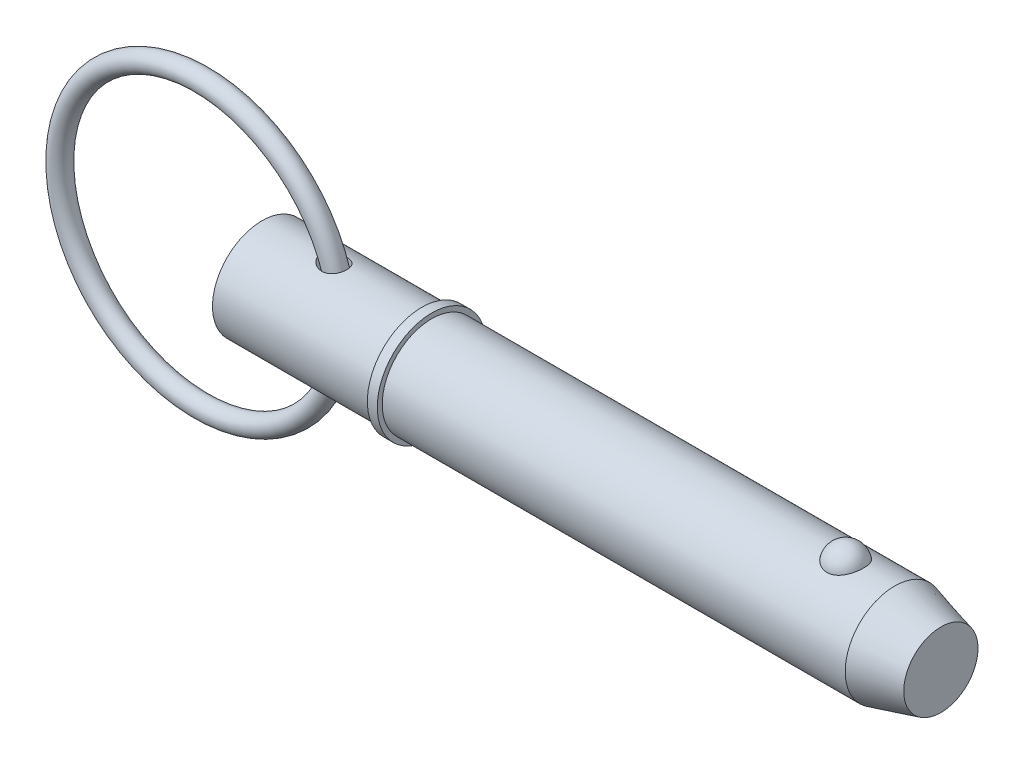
ISO-10303-21;
HEADER;
FILE_DESCRIPTION(('STEP AP214'),'2;1');
FILE_NAME('part.step','',(''),(''),'','','');
FILE_SCHEMA(('AUTOMOTIVE_DESIGN { 1 0 10303 214 1 1 1 1 }'));
ENDSEC;
DATA;
#1=APPLICATION_CONTEXT('core data for automotive mechanical design processes');
#2=APPLICATION_PROTOCOL_DEFINITION('international standard','automotive_design',2000,#1);
#3=PRODUCT_CONTEXT('',#1,'mechanical');
#4=PRODUCT('Part','Part','',(#3));
#5=PRODUCT_RELATED_PRODUCT_CATEGORY('part','',(#4));
#6=PRODUCT_DEFINITION_FORMATION('','',#4);
#7=PRODUCT_DEFINITION_CONTEXT('part definition',#1,'design');
#8=PRODUCT_DEFINITION('design','',#6,#7);
#9=PRODUCT_DEFINITION_SHAPE('','',#8);
#10=(LENGTH_UNIT() NAMED_UNIT(*) SI_UNIT(.MILLI.,.METRE.));
#11=(NAMED_UNIT(*) PLANE_ANGLE_UNIT() SI_UNIT($,.RADIAN.));
#12=(NAMED_UNIT(*) SI_UNIT($,.STERADIAN.) SOLID_ANGLE_UNIT());
#13=UNCERTAINTY_MEASURE_WITH_UNIT(LENGTH_MEASURE(1.E-05),#10,'distance_accuracy_value','');
#14=(GEOMETRIC_REPRESENTATION_CONTEXT(3) GLOBAL_UNCERTAINTY_ASSIGNED_CONTEXT((#13)) GLOBAL_UNIT_ASSIGNED_CONTEXT((#10,
#11,#12)) REPRESENTATION_CONTEXT('',''));
#15=CARTESIAN_POINT('',(0.,0.,0.));
#16=DIRECTION('',(0.,0.,1.));
#17=DIRECTION('',(1.,0.,0.));
#18=AXIS2_PLACEMENT_3D('',#15,#16,#17);
#19=CARTESIAN_POINT('',(-13.640845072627,0.,0.));
#20=DIRECTION('',(0.,0.,1.));
#21=DIRECTION('',(1.,0.,0.));
#22=AXIS2_PLACEMENT_3D('',#19,#20,#21);
#23=TOROIDAL_SURFACE('',#22,31.75,2.223);
#24=CARTESIAN_POINT('',(20.332154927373,0.,0.));
#25=VERTEX_POINT('',#24);
#26=VERTEX_LOOP('',#25);
#27=FACE_BOUND('',#26,.T.);
#28=ADVANCED_FACE('P0_F12',(#27),#23,.T.);
#29=CLOSED_SHELL('',(#28));
#30=MANIFOLD_SOLID_BREP('P0_B1',#29);
#31=CARTESIAN_POINT('',(0.,0.,0.));
#32=DIRECTION('',(1.,0.,0.));
#33=DIRECTION('',(0.,0.,-1.));
#34=AXIS2_PLACEMENT_3D('',#31,#32,#33);
#35=CYLINDRICAL_SURFACE('',#34,11.115);
#36=CARTESIAN_POINT('',(13.5245830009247,11.0328953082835,-1.34849772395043));
#37=CARTESIAN_POINT('',(13.6190616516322,11.0150940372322,-1.49413162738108));
#38=CARTESIAN_POINT('',(13.7272589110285,10.9954577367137,-1.63076546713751));
#39=CARTESIAN_POINT('',(13.9654537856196,10.9550099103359,-1.8834727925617));
#40=CARTESIAN_POINT('',(14.0954990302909,10.9341958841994,-1.99950019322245));
#41=CARTESIAN_POINT('',(14.3718600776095,10.893854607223,-2.20871939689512));
#42=CARTESIAN_POINT('',(14.5180879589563,10.8743212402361,-2.30202655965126));
#43=CARTESIAN_POINT('',(14.8233821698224,10.8385071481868,-2.46515115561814));
#44=CARTESIAN_POINT('',(14.9824448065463,10.8222254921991,-2.53497531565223));
#45=CARTESIAN_POINT('',(15.3233581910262,10.7936101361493,-2.65430007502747));
#46=CARTESIAN_POINT('',(15.5060064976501,10.7817126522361,-2.7016502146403));
#47=CARTESIAN_POINT('',(15.8771124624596,10.7657570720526,-2.76455948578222));
#48=CARTESIAN_POINT('',(16.0655695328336,10.7616981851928,-2.78012182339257));
#49=CARTESIAN_POINT('',(16.4345152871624,10.7624400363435,-2.77724928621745));
#50=CARTESIAN_POINT('',(16.6150121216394,10.7668823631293,-2.76018977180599));
#51=CARTESIAN_POINT('',(16.9695132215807,10.7837407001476,-2.69357457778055));
#52=CARTESIAN_POINT('',(17.1435222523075,10.7961507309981,-2.64404326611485));
#53=CARTESIAN_POINT('',(17.4621418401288,10.8258984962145,-2.51928348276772));
#54=CARTESIAN_POINT('',(17.6079677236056,10.8426430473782,-2.44700611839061));
#55=CARTESIAN_POINT('',(17.884162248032,10.8794194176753,-2.27791740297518));
#56=CARTESIAN_POINT('',(18.0145349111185,10.8994503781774,-2.18111245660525));
#57=CARTESIAN_POINT('',(18.2494965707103,10.9392822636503,-1.9713196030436));
#58=CARTESIAN_POINT('',(18.3550661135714,10.9590421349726,-1.85941863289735));
#59=CARTESIAN_POINT('',(18.5458147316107,10.9970986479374,-1.61919918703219));
#60=CARTESIAN_POINT('',(18.6309947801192,11.0153953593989,-1.49088149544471));
#61=CARTESIAN_POINT('',(18.7786686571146,11.0484675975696,-1.2218388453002));
#62=CARTESIAN_POINT('',(18.8412214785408,11.063252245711,-1.08114735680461));
#63=CARTESIAN_POINT('',(18.9425265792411,11.0877718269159,-0.791025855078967));
#64=CARTESIAN_POINT('',(18.9812780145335,11.0975065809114,-0.641595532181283));
#65=CARTESIAN_POINT('',(19.0343305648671,11.1109435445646,-0.336997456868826));
#66=CARTESIAN_POINT('',(19.0484404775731,11.1145985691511,-0.181794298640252));
#67=CARTESIAN_POINT('',(19.0513147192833,11.1153384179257,0.128864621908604));
#68=CARTESIAN_POINT('',(19.0400783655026,11.112423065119,0.284320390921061));
#69=CARTESIAN_POINT('',(18.9924362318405,11.1003163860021,0.591525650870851));
#70=CARTESIAN_POINT('',(18.9559600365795,11.0911075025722,0.743263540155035));
#71=CARTESIAN_POINT('',(18.858576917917,11.0673920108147,1.0382524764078));
#72=CARTESIAN_POINT('',(18.7976699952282,11.0528854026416,1.18150352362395));
#73=CARTESIAN_POINT('',(18.6529960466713,11.020201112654,1.45511394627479));
#74=CARTESIAN_POINT('',(18.5692772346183,11.0020311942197,1.58549973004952));
#75=CARTESIAN_POINT('',(18.3810003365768,10.9640237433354,1.82995492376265));
#76=CARTESIAN_POINT('',(18.2764441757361,10.9441863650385,1.94402583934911));
#77=CARTESIAN_POINT('',(18.0501398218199,10.9052267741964,2.15183128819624));
#78=CARTESIAN_POINT('',(17.9285270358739,10.8861003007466,2.24571250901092));
#79=CARTESIAN_POINT('',(17.6709592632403,10.8505244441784,2.41175942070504));
#80=CARTESIAN_POINT('',(17.5350055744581,10.8340748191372,2.48392707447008));
#81=CARTESIAN_POINT('',(17.2528390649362,10.8056099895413,2.60497667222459));
#82=CARTESIAN_POINT('',(17.1066353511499,10.7935909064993,2.65387899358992));
#83=CARTESIAN_POINT('',(16.8080326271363,10.7750969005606,2.72799859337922));
#84=CARTESIAN_POINT('',(16.6556326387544,10.7686228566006,2.75321211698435));
#85=CARTESIAN_POINT('',(16.3428877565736,10.761517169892,2.78086153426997));
#86=CARTESIAN_POINT('',(16.1824599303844,10.7611149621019,2.78240297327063));
#87=CARTESIAN_POINT('',(15.863296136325,10.766478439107,2.76156874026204));
#88=CARTESIAN_POINT('',(15.7045607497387,10.7722461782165,2.73918510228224));
#89=CARTESIAN_POINT('',(15.3787211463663,10.7898500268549,2.66904167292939));
#90=CARTESIAN_POINT('',(15.2120794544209,10.8021675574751,2.61925575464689));
#91=CARTESIAN_POINT('',(14.8886284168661,10.8315482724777,2.49496357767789));
#92=CARTESIAN_POINT('',(14.731827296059,10.8486153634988,2.42043695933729));
#93=CARTESIAN_POINT('',(14.4198762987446,10.8870804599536,2.24137362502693));
#94=CARTESIAN_POINT('',(14.2658484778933,10.9087148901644,2.13492229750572));
#95=CARTESIAN_POINT('',(13.9788214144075,10.9526299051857,1.89676517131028));
#96=CARTESIAN_POINT('',(13.8458041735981,10.9749099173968,1.76508120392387));
#97=CARTESIAN_POINT('',(13.6310853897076,11.012885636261,1.50762337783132));
#98=CARTESIAN_POINT('',(13.5444453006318,11.0290026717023,1.38602082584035));
#99=CARTESIAN_POINT('',(13.392158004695,11.0581740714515,1.12983363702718));
#100=CARTESIAN_POINT('',(13.3264946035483,11.0712307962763,0.995259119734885));
#101=CARTESIAN_POINT('',(13.2464179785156,11.0874250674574,0.785640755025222));
#102=CARTESIAN_POINT('',(13.2227369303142,11.0922707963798,0.714166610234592));
#103=CARTESIAN_POINT('',(13.1820656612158,11.1006486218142,0.569277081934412));
#104=CARTESIAN_POINT('',(13.1650721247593,11.1041813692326,0.495862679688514));
#105=CARTESIAN_POINT('',(13.1381118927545,11.1098070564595,0.347711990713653));
#106=CARTESIAN_POINT('',(13.1281436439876,11.1119003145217,0.272975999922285));
#107=CARTESIAN_POINT('',(13.1154243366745,11.1145746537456,0.122890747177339));
#108=CARTESIAN_POINT('',(13.1126723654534,11.1151559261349,0.0475415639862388));
#109=CARTESIAN_POINT('',(13.115160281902,11.1146296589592,-0.160384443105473));
#110=CARTESIAN_POINT('',(13.128061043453,11.111903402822,-0.292944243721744));
#111=CARTESIAN_POINT('',(13.175691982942,11.1019662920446,-0.553751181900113));
#112=CARTESIAN_POINT('',(13.2104121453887,11.094757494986,-0.682000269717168));
#113=CARTESIAN_POINT('',(13.2891255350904,11.0787645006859,-0.901873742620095));
#114=CARTESIAN_POINT('',(13.3290466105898,11.0707438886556,-0.995044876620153));
#115=CARTESIAN_POINT('',(13.4192915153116,11.0529876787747,-1.17599209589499));
#116=CARTESIAN_POINT('',(13.4696154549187,11.0432520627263,-1.26376812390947));
#117=CARTESIAN_POINT('',(13.5245830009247,11.0328953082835,-1.34849772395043));
#118=B_SPLINE_CURVE_WITH_KNOTS('',3,(#36,#37,#38,#39,#40,#41,#42,#43,#44,#45,#46,#47,#48,#49,
#50,#51,#52,#53,#54,#55,#56,#57,#58,#59,#60,#61,#62,#63,#64,#65,#66,#67,#68,#69,#70,#71,#72,#73,
#74,#75,#76,#77,#78,#79,#80,#81,#82,#83,#84,#85,#86,#87,#88,#89,#90,#91,#92,#93,#94,#95,#96,#97,
#98,#99,#100,#101,#102,#103,#104,#105,#106,#107,#108,#109,#110,#111,#112,#113,#114,#115,#116,
#117),.UNSPECIFIED.,.T.,.F.,(4,2,2,2,2,2,2,2,2,2,2,2,2,2,2,2,2,2,2,2,2,2,2,2,2,2,2,2,2,2,2,2,2,
2,2,2,2,2,2,2,4),(0.,0.52309976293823,1.04735506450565,1.56889024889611,2.09027590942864,
2.65465173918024,3.21897064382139,3.76002078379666,4.30066536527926,4.78898318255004,
5.27717362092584,5.74028268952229,6.20336964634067,6.665240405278,7.12712754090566,
7.59258295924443,8.05805091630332,8.52482272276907,8.99159451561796,9.45738731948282,
9.9231371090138,10.3853792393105,10.8475795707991,11.3093743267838,11.7712422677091,
12.2505208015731,12.7299589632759,13.2508366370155,13.7721440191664,14.334890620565,
14.8971525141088,15.3459336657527,15.7943675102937,16.0204422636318,16.2464047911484,
16.4723173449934,16.6982013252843,17.095711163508,17.4930386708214,17.7973741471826,
18.1017128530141),.UNSPECIFIED.);
#119=CARTESIAN_POINT('',(13.5245830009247,11.0328953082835,-1.34849772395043));
#120=VERTEX_POINT('',#119);
#121=EDGE_CURVE('P1_E42',#120,#120,#118,.T.);
#122=ORIENTED_EDGE('',*,*,#121,.T.);
#123=EDGE_LOOP('',(#122));
#124=FACE_BOUND('',#123,.T.);
#125=CARTESIAN_POINT('',(0.,0.,0.));
#126=DIRECTION('',(1.,0.,0.));
#127=DIRECTION('',(0.,0.,-1.));
#128=AXIS2_PLACEMENT_3D('',#125,#126,#127);
#129=CIRCLE('',#128,11.115);
#130=CARTESIAN_POINT('',(0.,0.,-11.115));
#131=VERTEX_POINT('',#130);
#132=EDGE_CURVE('P1_E9',#131,#131,#129,.T.);
#133=ORIENTED_EDGE('',*,*,#132,.T.);
#134=EDGE_LOOP('',(#133));
#135=FACE_BOUND('',#134,.T.);
#136=CARTESIAN_POINT('',(35.877,0.,0.));
#137=DIRECTION('',(1.,0.,0.));
#138=DIRECTION('',(0.,0.,-1.));
#139=AXIS2_PLACEMENT_3D('',#136,#137,#138);
#140=CIRCLE('',#139,11.115);
#141=CARTESIAN_POINT('',(35.877,0.,-11.115));
#142=VERTEX_POINT('',#141);
#143=EDGE_CURVE('P1_E25',#142,#142,#140,.T.);
#144=ORIENTED_EDGE('',*,*,#143,.F.);
#145=EDGE_LOOP('',(#144));
#146=FACE_BOUND('',#145,.T.);
#147=CARTESIAN_POINT('',(13.5245830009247,-11.0328953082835,-1.34849772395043));
#148=CARTESIAN_POINT('',(13.449887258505,-11.0469690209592,-1.233356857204));
#149=CARTESIAN_POINT('',(13.3837464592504,-11.0598986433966,-1.11255897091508));
#150=CARTESIAN_POINT('',(13.271526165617,-11.0822620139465,-0.861680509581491));
#151=CARTESIAN_POINT('',(13.2254273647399,-11.0916991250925,-0.731609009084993));
#152=CARTESIAN_POINT('',(13.1557497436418,-11.1060943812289,-0.464578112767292));
#153=CARTESIAN_POINT('',(13.1322820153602,-11.111030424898,-0.327588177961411));
#154=CARTESIAN_POINT('',(13.1098958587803,-11.1157368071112,-0.0515139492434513));
#155=CARTESIAN_POINT('',(13.1109730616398,-11.1155080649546,0.0875699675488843));
#156=CARTESIAN_POINT('',(13.1367722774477,-11.110088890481,0.354927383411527));
#157=CARTESIAN_POINT('',(13.160070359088,-11.1051972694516,0.483348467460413));
#158=CARTESIAN_POINT('',(13.2268311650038,-11.091413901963,0.734581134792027));
#159=CARTESIAN_POINT('',(13.2702981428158,-11.0825213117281,0.857391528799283));
#160=CARTESIAN_POINT('',(13.3769008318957,-11.0612491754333,1.09871322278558));
#161=CARTESIAN_POINT('',(13.4406446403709,-11.048763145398,1.21694419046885));
#162=CARTESIAN_POINT('',(13.5844860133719,-11.0215642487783,1.44267020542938));
#163=CARTESIAN_POINT('',(13.6645903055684,-11.0068504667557,1.55016080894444));
#164=CARTESIAN_POINT('',(13.8511803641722,-10.9741237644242,1.76795565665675));
#165=CARTESIAN_POINT('',(13.959808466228,-10.9559422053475,1.87639683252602));
#166=CARTESIAN_POINT('',(14.1916437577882,-10.9197998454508,2.07642617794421));
#167=CARTESIAN_POINT('',(14.3148607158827,-10.901839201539,2.16800294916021));
#168=CARTESIAN_POINT('',(14.5931107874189,-10.8649902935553,2.34622033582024));
#169=CARTESIAN_POINT('',(14.7501095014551,-10.8463937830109,2.42986679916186));
#170=CARTESIAN_POINT('',(15.0757118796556,-10.8136392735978,2.57171975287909));
#171=CARTESIAN_POINT('',(15.2443214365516,-10.7994835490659,2.62991321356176));
#172=CARTESIAN_POINT('',(15.599068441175,-10.7767894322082,2.72147498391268));
#173=CARTESIAN_POINT('',(15.7856559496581,-10.768622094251,2.75321798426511));
#174=CARTESIAN_POINT('',(16.1617095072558,-10.7608206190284,2.78356776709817));
#175=CARTESIAN_POINT('',(16.3511739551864,-10.7611818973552,2.78219235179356));
#176=CARTESIAN_POINT('',(16.7138126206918,-10.7705428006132,2.7457129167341));
#177=CARTESIAN_POINT('',(16.8872269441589,-10.7789612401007,2.71287798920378));
#178=CARTESIAN_POINT('',(17.2247245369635,-10.8028011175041,2.61632772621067));
#179=CARTESIAN_POINT('',(17.3888134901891,-10.8182182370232,2.55263143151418));
#180=CARTESIAN_POINT('',(17.6871641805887,-10.8524191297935,2.40281428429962));
#181=CARTESIAN_POINT('',(17.8227812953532,-10.8707652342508,2.31928155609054));
#182=CARTESIAN_POINT('',(18.0770765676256,-10.9094513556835,2.12988301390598));
#183=CARTESIAN_POINT('',(18.1957578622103,-10.9297910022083,2.0240213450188));
#184=CARTESIAN_POINT('',(18.4088055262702,-10.9693230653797,1.79719870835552));
#185=CARTESIAN_POINT('',(18.5038890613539,-10.9885305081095,1.67691225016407));
#186=CARTESIAN_POINT('',(18.6726701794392,-11.0244347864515,1.42183894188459));
#187=CARTESIAN_POINT('',(18.7463681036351,-11.0411316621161,1.28705232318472));
#188=CARTESIAN_POINT('',(18.8708297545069,-11.0702507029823,1.00634471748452));
#189=CARTESIAN_POINT('',(18.9215212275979,-11.0826593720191,0.860390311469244));
#190=CARTESIAN_POINT('',(18.9984973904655,-11.1017993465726,0.561823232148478));
#191=CARTESIAN_POINT('',(19.0247811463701,-11.1085304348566,0.409210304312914));
#192=CARTESIAN_POINT('',(19.0524622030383,-11.1156244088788,0.100537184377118));
#193=CARTESIAN_POINT('',(19.0536873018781,-11.1159432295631,-0.0555394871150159));
#194=CARTESIAN_POINT('',(19.0307837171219,-11.110065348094,-0.365700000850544));
#195=CARTESIAN_POINT('',(19.0066544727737,-11.1038685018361,-0.519783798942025));
#196=CARTESIAN_POINT('',(18.9335163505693,-11.0856111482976,-0.821817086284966));
#197=CARTESIAN_POINT('',(18.88447016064,-11.0735418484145,-0.969757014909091));
#198=CARTESIAN_POINT('',(18.7625929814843,-11.0448501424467,-1.25502066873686));
#199=CARTESIAN_POINT('',(18.6897623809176,-11.0282278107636,-1.39234456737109));
#200=CARTESIAN_POINT('',(18.522359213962,-10.9923333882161,-1.65195905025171));
#201=CARTESIAN_POINT('',(18.427863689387,-10.9730707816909,-1.77430060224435));
#202=CARTESIAN_POINT('',(18.2194216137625,-10.9340072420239,-2.00099176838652));
#203=CARTESIAN_POINT('',(18.1054772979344,-10.9142063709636,-2.10534344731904));
#204=CARTESIAN_POINT('',(17.8622613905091,-10.8764452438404,-2.2924289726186));
#205=CARTESIAN_POINT('',(17.7331196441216,-10.8584715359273,-2.3753290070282));
#206=CARTESIAN_POINT('',(17.4625069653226,-10.8261386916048,-2.51860389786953));
#207=CARTESIAN_POINT('',(17.3210365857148,-10.8117793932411,-2.57897976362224));
#208=CARTESIAN_POINT('',(17.0290309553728,-10.7880576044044,-2.67648805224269));
#209=CARTESIAN_POINT('',(16.8784484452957,-10.7787241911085,-2.71348542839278));
#210=CARTESIAN_POINT('',(16.573148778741,-10.7659618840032,-2.7636855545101));
#211=CARTESIAN_POINT('',(16.4184306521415,-10.7625343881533,-2.77688267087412));
#212=CARTESIAN_POINT('',(16.1008073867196,-10.761643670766,-2.78033419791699));
#213=CARTESIAN_POINT('',(15.9378898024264,-10.7644957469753,-2.76937572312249));
#214=CARTESIAN_POINT('',(15.6157286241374,-10.7762062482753,-2.72344300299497));
#215=CARTESIAN_POINT('',(15.4564861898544,-10.7850665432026,-2.68846128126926));
#216=CARTESIAN_POINT('',(15.1305734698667,-10.808737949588,-2.59174021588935));
#217=CARTESIAN_POINT('',(14.9645834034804,-10.8240246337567,-2.52782071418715));
#218=CARTESIAN_POINT('',(14.6448218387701,-10.8585969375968,-2.37491543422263));
#219=CARTESIAN_POINT('',(14.4910653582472,-10.8778873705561,-2.28589943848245));
#220=CARTESIAN_POINT('',(14.1837929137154,-10.920550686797,-2.07312951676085));
#221=CARTESIAN_POINT('',(14.0321999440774,-10.9441390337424,-1.94661563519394));
#222=CARTESIAN_POINT('',(13.756115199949,-10.9902311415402,-1.66673537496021));
#223=CARTESIAN_POINT('',(13.6315733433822,-11.0127368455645,-1.51341958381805));
#224=CARTESIAN_POINT('',(13.5245830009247,-11.0328953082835,-1.34849772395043));
#225=B_SPLINE_CURVE_WITH_KNOTS('',3,(#147,#148,#149,#150,#151,#152,#153,#154,#155,#156,#157,
#158,#159,#160,#161,#162,#163,#164,#165,#166,#167,#168,#169,#170,#171,#172,#173,#174,#175,#176,
#177,#178,#179,#180,#181,#182,#183,#184,#185,#186,#187,#188,#189,#190,#191,#192,#193,#194,#195,
#196,#197,#198,#199,#200,#201,#202,#203,#204,#205,#206,#207,#208,#209,#210,#211,#212,#213,#214,
#215,#216,#217,#218,#219,#220,#221,#222,#223,#224),.UNSPECIFIED.,.T.,.F.,(4,2,2,2,2,2,2,2,2,2,2,
2,2,2,2,2,2,2,2,2,2,2,2,2,2,2,2,2,2,2,2,2,2,2,2,2,2,2,4),(0.,0.4133945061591,0.8263899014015,
1.24140245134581,1.65634113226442,2.04635967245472,2.43646050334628,2.83958259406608,
3.24287078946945,3.70479277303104,4.16702582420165,4.70130512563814,5.23585761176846,
5.80123945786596,6.36631739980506,6.89348344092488,7.42032464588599,7.8989135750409,
8.37741373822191,8.83881993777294,9.30021877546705,9.76305681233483,10.2259125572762,
10.6919479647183,11.1579936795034,11.6247393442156,12.0914773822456,12.55658073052,
13.0216306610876,13.4829619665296,13.9442725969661,14.408224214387,14.8722856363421,
15.3601762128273,15.8482186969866,16.3815107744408,16.9154477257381,17.5086806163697,
18.1008056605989),.UNSPECIFIED.);
#226=CARTESIAN_POINT('',(13.5245830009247,-11.0328953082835,-1.34849772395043));
#227=VERTEX_POINT('',#226);
#228=EDGE_CURVE('P1_E17',#227,#227,#225,.T.);
#229=ORIENTED_EDGE('',*,*,#228,.T.);
#230=EDGE_LOOP('',(#229));
#231=FACE_BOUND('',#230,.T.);
#232=ADVANCED_FACE('P1_F13',(#124,#135,#146,#231),#35,.T.);
#233=CARTESIAN_POINT('',(0.,0.,0.));
#234=DIRECTION('',(1.,0.,0.));
#235=DIRECTION('',(0.,0.,-1.));
#236=AXIS2_PLACEMENT_3D('',#233,#234,#235);
#237=CYLINDRICAL_SURFACE('',#236,11.115);
#238=CARTESIAN_POINT('',(142.029563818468,0.,0.));
#239=DIRECTION('',(1.,0.,0.));
#240=DIRECTION('',(0.,0.,-1.));
#241=AXIS2_PLACEMENT_3D('',#238,#239,#240);
#242=CIRCLE('',#241,11.115);
#243=CARTESIAN_POINT('',(142.029563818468,0.,-11.115));
#244=VERTEX_POINT('',#243);
#245=EDGE_CURVE('P1_E99',#244,#244,#242,.T.);
#246=ORIENTED_EDGE('',*,*,#245,.F.);
#247=EDGE_LOOP('',(#246));
#248=FACE_BOUND('',#247,.T.);
#249=CARTESIAN_POINT('',(38.1,0.,0.));
#250=DIRECTION('',(1.,0.,0.));
#251=DIRECTION('',(0.,0.,-1.));
#252=AXIS2_PLACEMENT_3D('',#249,#250,#251);
#253=CIRCLE('',#252,11.115);
#254=CARTESIAN_POINT('',(38.1,0.,-11.115));
#255=VERTEX_POINT('',#254);
#256=EDGE_CURVE('P1_E96',#255,#255,#253,.T.);
#257=ORIENTED_EDGE('',*,*,#256,.T.);
#258=EDGE_LOOP('',(#257));
#259=FACE_BOUND('',#258,.T.);
#260=CARTESIAN_POINT('',(131.031068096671,10.3028087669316,4.17077409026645));
#261=CARTESIAN_POINT('',(130.814775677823,10.3028003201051,4.17078240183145));
#262=CARTESIAN_POINT('',(130.598548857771,10.3098895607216,4.15340593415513));
#263=CARTESIAN_POINT('',(130.172540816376,10.3373834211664,4.08449540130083));
#264=CARTESIAN_POINT('',(129.962757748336,10.3577841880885,4.0329712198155));
#265=CARTESIAN_POINT('',(129.555782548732,10.4095237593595,3.89746513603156));
#266=CARTESIAN_POINT('',(129.358572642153,10.4408466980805,3.81353029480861));
#267=CARTESIAN_POINT('',(128.981338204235,10.5110236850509,3.61560339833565));
#268=CARTESIAN_POINT('',(128.801317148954,10.5498792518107,3.50160528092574));
#269=CARTESIAN_POINT('',(128.457684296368,10.6322884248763,3.24292464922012));
#270=CARTESIAN_POINT('',(128.294686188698,10.6759443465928,3.09746040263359));
#271=CARTESIAN_POINT('',(127.994591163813,10.7625291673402,2.7817192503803));
#272=CARTESIAN_POINT('',(127.857499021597,10.8054579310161,2.61143778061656));
#273=CARTESIAN_POINT('',(127.606408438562,10.8881935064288,2.24226695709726));
#274=CARTESIAN_POINT('',(127.493710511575,10.9277761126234,2.04244123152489));
#275=CARTESIAN_POINT('',(127.301777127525,10.997484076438,1.62578254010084));
#276=CARTESIAN_POINT('',(127.222544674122,11.0276085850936,1.40894804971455));
#277=CARTESIAN_POINT('',(127.098303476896,11.0756732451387,0.961250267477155));
#278=CARTESIAN_POINT('',(127.053760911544,11.0934470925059,0.730239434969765));
#279=CARTESIAN_POINT('',(127.001569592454,11.1143331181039,0.263439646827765));
#280=CARTESIAN_POINT('',(126.993920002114,11.1174456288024,0.0276507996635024));
#281=CARTESIAN_POINT('',(127.01561056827,11.1087161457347,-0.44072963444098));
#282=CARTESIAN_POINT('',(127.044762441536,11.0969502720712,-0.673331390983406));
#283=CARTESIAN_POINT('',(127.139143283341,11.0597872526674,-1.12996621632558));
#284=CARTESIAN_POINT('',(127.204372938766,11.0343898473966,-1.35399912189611));
#285=CARTESIAN_POINT('',(127.36969844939,10.972515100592,-1.78750286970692));
#286=CARTESIAN_POINT('',(127.46983863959,10.9360236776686,-1.99695478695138));
#287=CARTESIAN_POINT('',(127.702940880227,10.8557595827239,-2.39520667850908));
#288=CARTESIAN_POINT('',(127.835905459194,10.8119863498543,-2.58400506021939));
#289=CARTESIAN_POINT('',(128.132407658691,10.7216733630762,-2.93635726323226));
#290=CARTESIAN_POINT('',(128.296056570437,10.675123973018,-3.09981510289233));
#291=CARTESIAN_POINT('',(128.649860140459,10.5846571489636,-3.39592247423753));
#292=CARTESIAN_POINT('',(128.840012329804,10.5407394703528,-3.52857487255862));
#293=CARTESIAN_POINT('',(129.23750141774,10.4616690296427,-3.75646057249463));
#294=CARTESIAN_POINT('',(129.44436705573,10.4263443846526,-3.85245432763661));
#295=CARTESIAN_POINT('',(129.872954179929,10.3675574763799,-4.00798747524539));
#296=CARTESIAN_POINT('',(130.094670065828,10.344090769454,-4.0675405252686));
#297=CARTESIAN_POINT('',(130.534669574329,10.3128282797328,-4.14614314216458));
#298=CARTESIAN_POINT('',(130.752565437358,10.3043040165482,-4.1670783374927));
#299=CARTESIAN_POINT('',(131.18894951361,10.3016771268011,-4.17357158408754));
#300=CARTESIAN_POINT('',(131.407437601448,10.3075716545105,-4.15913661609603));
#301=CARTESIAN_POINT('',(131.831744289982,10.3326686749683,-4.09636961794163));
#302=CARTESIAN_POINT('',(132.037745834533,10.3514555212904,-4.0490957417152));
#303=CARTESIAN_POINT('',(132.438576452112,10.399818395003,-3.92320197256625));
#304=CARTESIAN_POINT('',(132.6334046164,10.4293952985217,-3.84457953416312));
#305=CARTESIAN_POINT('',(133.011191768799,10.4969600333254,-3.65612410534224));
#306=CARTESIAN_POINT('',(133.193797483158,10.5351178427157,-3.54564545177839));
#307=CARTESIAN_POINT('',(133.538204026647,10.6154999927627,-3.29718036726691));
#308=CARTESIAN_POINT('',(133.700000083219,10.657725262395,-3.15918764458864));
#309=CARTESIAN_POINT('',(134.006959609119,10.744212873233,-2.85163580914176));
#310=CARTESIAN_POINT('',(134.150891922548,10.7884718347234,-2.68084605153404));
#311=CARTESIAN_POINT('',(134.409237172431,10.872374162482,-2.31721864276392));
#312=CARTESIAN_POINT('',(134.523644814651,10.9120167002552,-2.12437704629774));
#313=CARTESIAN_POINT('',(134.723873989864,10.9838919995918,-1.71516999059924));
#314=CARTESIAN_POINT('',(134.80866178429,11.0158465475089,-1.49824866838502));
#315=CARTESIAN_POINT('',(134.94268382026,11.0673523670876,-1.05228572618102));
#316=CARTESIAN_POINT('',(134.991917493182,11.086903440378,-0.823243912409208));
#317=CARTESIAN_POINT('',(135.053891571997,11.1116323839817,-0.3590874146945));
#318=CARTESIAN_POINT('',(135.066566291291,11.1167843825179,-0.123962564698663));
#319=CARTESIAN_POINT('',(135.054973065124,11.1121144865,0.345220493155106));
#320=CARTESIAN_POINT('',(135.030705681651,11.1022928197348,0.579278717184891));
#321=CARTESIAN_POINT('',(134.945907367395,11.0687504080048,1.03866534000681));
#322=CARTESIAN_POINT('',(134.885529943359,11.0450885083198,1.26402641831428));
#323=CARTESIAN_POINT('',(134.729853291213,10.9863185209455,1.70076772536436));
#324=CARTESIAN_POINT('',(134.634551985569,10.9512097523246,1.91214712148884));
#325=CARTESIAN_POINT('',(134.410397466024,10.8729733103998,2.316083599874));
#326=CARTESIAN_POINT('',(134.281380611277,10.8298068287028,2.50854240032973));
#327=CARTESIAN_POINT('',(133.992732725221,10.7401896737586,2.86808766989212));
#328=CARTESIAN_POINT('',(133.833102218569,10.6937390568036,3.03517457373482));
#329=CARTESIAN_POINT('',(133.487534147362,10.6029321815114,3.33857581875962));
#330=CARTESIAN_POINT('',(133.301708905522,10.5585680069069,3.47501541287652));
#331=CARTESIAN_POINT('',(132.907875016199,10.4769321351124,3.71390897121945));
#332=CARTESIAN_POINT('',(132.699863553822,10.439661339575,3.81635861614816));
#333=CARTESIAN_POINT('',(132.254066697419,10.3749407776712,3.98910631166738));
#334=CARTESIAN_POINT('',(132.015234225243,10.3482457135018,4.05700929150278));
#335=CARTESIAN_POINT('',(131.527925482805,10.312188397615,4.14782844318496));
#336=CARTESIAN_POINT('',(131.279453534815,10.3028184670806,4.17076454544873));
#337=CARTESIAN_POINT('',(131.031068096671,10.3028087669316,4.17077409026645));
#338=B_SPLINE_CURVE_WITH_KNOTS('',3,(#260,#261,#262,#263,#264,#265,#266,#267,#268,#269,#270,
#271,#272,#273,#274,#275,#276,#277,#278,#279,#280,#281,#282,#283,#284,#285,#286,#287,#288,#289,
#290,#291,#292,#293,#294,#295,#296,#297,#298,#299,#300,#301,#302,#303,#304,#305,#306,#307,#308,
#309,#310,#311,#312,#313,#314,#315,#316,#317,#318,#319,#320,#321,#322,#323,#324,#325,#326,#327,
#328,#329,#330,#331,#332,#333,#334,#335,#336,#337),.UNSPECIFIED.,.T.,.F.,(4,2,2,2,2,2,2,2,2,2,2,
2,2,2,2,2,2,2,2,2,2,2,2,2,2,2,2,2,2,2,2,2,2,2,2,2,2,2,4),(0.,0.64796614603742,1.29574482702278,
1.94258643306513,2.58955857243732,3.25496465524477,3.92049326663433,4.61566368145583,
5.31089647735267,6.01531821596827,6.71972398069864,7.42054043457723,8.12137023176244,
8.8230933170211,9.52487047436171,10.2292439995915,10.9335519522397,11.6223330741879,
12.3108558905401,12.9647664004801,13.6185478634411,14.252184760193,14.8858731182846,
15.5334360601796,16.1811472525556,16.8611459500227,17.5412664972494,18.2431855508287,
18.9451158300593,19.6483065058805,20.3514864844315,21.0516982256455,21.7519516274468,
22.4556690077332,23.1593743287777,23.8601491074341,24.5610129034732,25.3054529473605,
26.049562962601),.UNSPECIFIED.);
#339=CARTESIAN_POINT('',(131.031068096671,10.3028087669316,4.17077409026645));
#340=VERTEX_POINT('',#339);
#341=EDGE_CURVE('P1_E34',#340,#340,#338,.T.);
#342=ORIENTED_EDGE('',*,*,#341,.T.);
#343=EDGE_LOOP('',(#342));
#344=FACE_BOUND('',#343,.T.);
#345=ADVANCED_FACE('P1_F46',(#248,#259,#344),#237,.T.);
#346=CARTESIAN_POINT('',(0.,0.,0.));
#347=DIRECTION('',(-1.,0.,0.));
#348=DIRECTION('',(0.,0.,1.));
#349=AXIS2_PLACEMENT_3D('',#346,#347,#348);
#350=PLANE('',#349);
#351=ORIENTED_EDGE('',*,*,#132,.F.);
#352=EDGE_LOOP('',(#351));
#353=FACE_BOUND('',#352,.T.);
#354=ADVANCED_FACE('P1_F15',(#353),#350,.T.);
#355=CARTESIAN_POINT('',(35.877,11.115,0.));
#356=DIRECTION('',(-1.,0.,0.));
#357=DIRECTION('',(0.,0.,1.));
#358=AXIS2_PLACEMENT_3D('',#355,#356,#357);
#359=PLANE('',#358);
#360=ORIENTED_EDGE('',*,*,#143,.T.);
#361=EDGE_LOOP('',(#360));
#362=FACE_BOUND('',#361,.T.);
#363=CARTESIAN_POINT('',(35.877,0.,0.));
#364=DIRECTION('',(1.,0.,0.));
#365=DIRECTION('',(0.,0.,-1.));
#366=AXIS2_PLACEMENT_3D('',#363,#364,#365);
#367=CIRCLE('',#366,12.2265);
#368=CARTESIAN_POINT('',(35.877,0.,-12.2265));
#369=VERTEX_POINT('',#368);
#370=EDGE_CURVE('P1_E30',#369,#369,#367,.T.);
#371=ORIENTED_EDGE('',*,*,#370,.F.);
#372=EDGE_LOOP('',(#371));
#373=FACE_BOUND('',#372,.T.);
#374=ADVANCED_FACE('P1_F81',(#362,#373),#359,.T.);
#375=CARTESIAN_POINT('',(0.,0.,0.));
#376=DIRECTION('',(1.,0.,0.));
#377=DIRECTION('',(0.,0.,-1.));
#378=AXIS2_PLACEMENT_3D('',#375,#376,#377);
#379=CYLINDRICAL_SURFACE('',#378,12.2265);
#380=ORIENTED_EDGE('',*,*,#370,.T.);
#381=EDGE_LOOP('',(#380));
#382=FACE_BOUND('',#381,.T.);
#383=CARTESIAN_POINT('',(38.1,0.,0.));
#384=DIRECTION('',(1.,0.,0.));
#385=DIRECTION('',(0.,0.,-1.));
#386=AXIS2_PLACEMENT_3D('',#383,#384,#385);
#387=CIRCLE('',#386,12.2265);
#388=CARTESIAN_POINT('',(38.1,0.,-12.2265));
#389=VERTEX_POINT('',#388);
#390=EDGE_CURVE('P1_E95',#389,#389,#387,.T.);
#391=ORIENTED_EDGE('',*,*,#390,.F.);
#392=EDGE_LOOP('',(#391));
#393=FACE_BOUND('',#392,.T.);
#394=ADVANCED_FACE('P1_F68',(#382,#393),#379,.T.);
#395=CARTESIAN_POINT('',(38.1,12.2265,0.));
#396=DIRECTION('',(1.,0.,0.));
#397=DIRECTION('',(0.,0.,-1.));
#398=AXIS2_PLACEMENT_3D('',#395,#396,#397);
#399=PLANE('',#398);
#400=ORIENTED_EDGE('',*,*,#390,.T.);
#401=EDGE_LOOP('',(#400));
#402=FACE_BOUND('',#401,.T.);
#403=ORIENTED_EDGE('',*,*,#256,.F.);
#404=EDGE_LOOP('',(#403));
#405=FACE_BOUND('',#404,.T.);
#406=ADVANCED_FACE('P1_F62',(#402,#405),#399,.T.);
#407=CARTESIAN_POINT('',(152.4,0.,0.));
#408=DIRECTION('',(-1.,0.,0.));
#409=DIRECTION('',(0.,0.,1.));
#410=AXIS2_PLACEMENT_3D('',#407,#408,#409);
#411=CONICAL_SURFACE('',#410,8.33625000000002,0.26179938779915);
#412=ORIENTED_EDGE('',*,*,#245,.T.);
#413=EDGE_LOOP('',(#412));
#414=FACE_BOUND('',#413,.T.);
#415=CARTESIAN_POINT('',(152.4,0.,0.));
#416=DIRECTION('',(1.,0.,0.));
#417=DIRECTION('',(0.,0.,-1.));
#418=AXIS2_PLACEMENT_3D('',#415,#416,#417);
#419=CIRCLE('',#418,8.33625000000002);
#420=CARTESIAN_POINT('',(152.4,0.,-8.33625000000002));
#421=VERTEX_POINT('',#420);
#422=EDGE_CURVE('P1_E41',#421,#421,#419,.T.);
#423=ORIENTED_EDGE('',*,*,#422,.F.);
#424=EDGE_LOOP('',(#423));
#425=FACE_BOUND('',#424,.T.);
#426=ADVANCED_FACE('P1_F59',(#414,#425),#411,.T.);
#427=CARTESIAN_POINT('',(152.4,8.33625000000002,0.));
#428=DIRECTION('',(1.,0.,0.));
#429=DIRECTION('',(0.,0.,-1.));
#430=AXIS2_PLACEMENT_3D('',#427,#428,#429);
#431=PLANE('',#430);
#432=ORIENTED_EDGE('',*,*,#422,.T.);
#433=EDGE_LOOP('',(#432));
#434=FACE_BOUND('',#433,.T.);
#435=ADVANCED_FACE('P1_F55',(#434),#431,.T.);
#436=CARTESIAN_POINT('',(131.031068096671,10.0035,0.));
#437=DIRECTION('',(-1.,0.,0.));
#438=DIRECTION('',(0.,1.,0.));
#439=AXIS2_PLACEMENT_3D('',#436,#437,#438);
#440=SPHERICAL_SURFACE('',#439,4.18150000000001);
#441=ORIENTED_EDGE('',*,*,#341,.F.);
#442=EDGE_LOOP('',(#441));
#443=FACE_BOUND('',#442,.T.);
#444=ADVANCED_FACE('P1_F50',(#443),#440,.T.);
#445=CARTESIAN_POINT('',(-13.640845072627,0.,0.));
#446=DIRECTION('',(0.,0.,1.));
#447=DIRECTION('',(1.,0.,0.));
#448=AXIS2_PLACEMENT_3D('',#445,#446,#447);
#449=TOROIDAL_SURFACE('',#448,31.75,2.77875);
#450=ORIENTED_EDGE('',*,*,#228,.F.);
#451=EDGE_LOOP('',(#450));
#452=FACE_BOUND('',#451,.T.);
#453=ORIENTED_EDGE('',*,*,#121,.F.);
#454=EDGE_LOOP('',(#453));
#455=FACE_BOUND('',#454,.T.);
#456=ADVANCED_FACE('P1_F54',(#452,#455),#449,.F.);
#457=CLOSED_SHELL('',(#232,#345,#354,#374,#394,#406,#426,#435,#444,#456));
#458=MANIFOLD_SOLID_BREP('P1_B1',#457);
#459=ADVANCED_BREP_SHAPE_REPRESENTATION('',(#18,#30,#458),#14);
#460=SHAPE_DEFINITION_REPRESENTATION(#9,#459);
ENDSEC;
END-ISO-10303-21;
